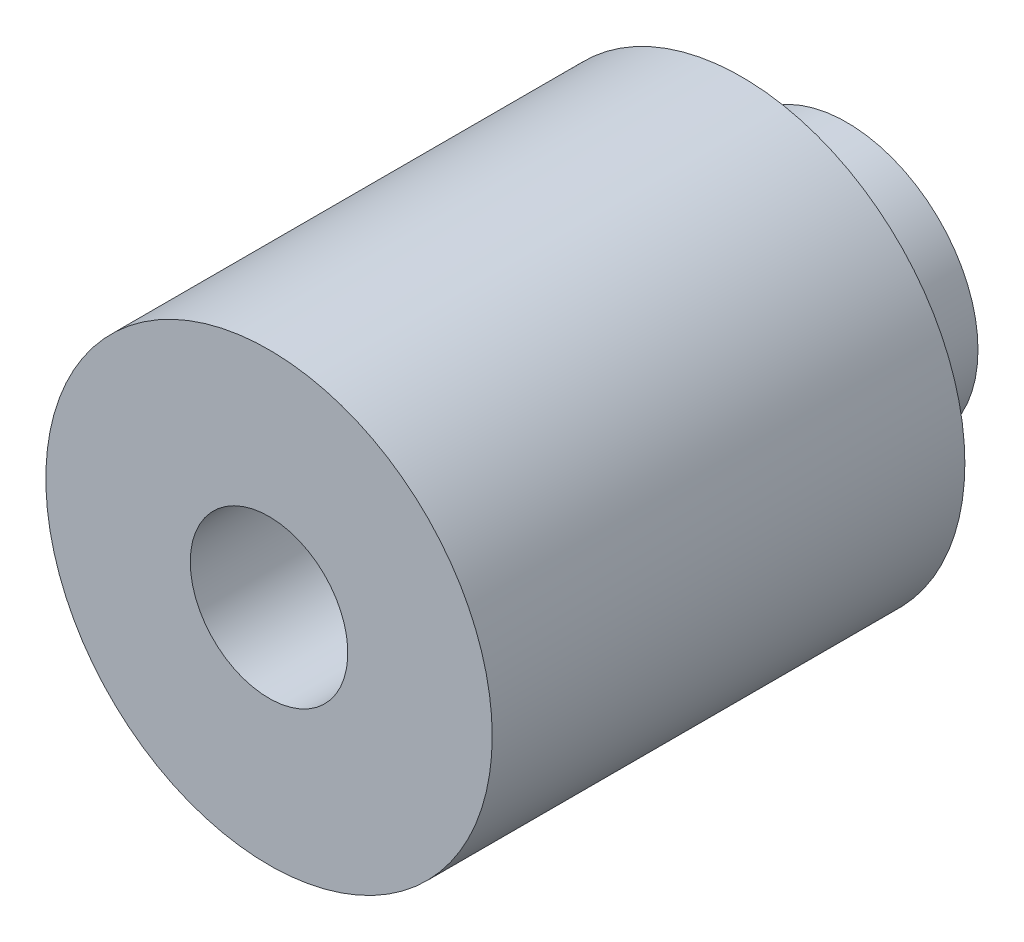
ISO-10303-21;
HEADER;
FILE_DESCRIPTION(('STEP AP214'),'2;1');
FILE_NAME('part.step','',(''),(''),'','','');
FILE_SCHEMA(('AUTOMOTIVE_DESIGN { 1 0 10303 214 1 1 1 1 }'));
ENDSEC;
DATA;
#1=APPLICATION_CONTEXT('core data for automotive mechanical design processes');
#2=APPLICATION_PROTOCOL_DEFINITION('international standard','automotive_design',2000,#1);
#3=PRODUCT_CONTEXT('',#1,'mechanical');
#4=PRODUCT('Part','Part','',(#3));
#5=PRODUCT_RELATED_PRODUCT_CATEGORY('part','',(#4));
#6=PRODUCT_DEFINITION_FORMATION('','',#4);
#7=PRODUCT_DEFINITION_CONTEXT('part definition',#1,'design');
#8=PRODUCT_DEFINITION('design','',#6,#7);
#9=PRODUCT_DEFINITION_SHAPE('','',#8);
#10=(LENGTH_UNIT() NAMED_UNIT(*) SI_UNIT(.MILLI.,.METRE.));
#11=(NAMED_UNIT(*) PLANE_ANGLE_UNIT() SI_UNIT($,.RADIAN.));
#12=(NAMED_UNIT(*) SI_UNIT($,.STERADIAN.) SOLID_ANGLE_UNIT());
#13=UNCERTAINTY_MEASURE_WITH_UNIT(LENGTH_MEASURE(1.E-05),#10,'distance_accuracy_value','');
#14=(GEOMETRIC_REPRESENTATION_CONTEXT(3) GLOBAL_UNCERTAINTY_ASSIGNED_CONTEXT((#13)) GLOBAL_UNIT_ASSIGNED_CONTEXT((#10,
#11,#12)) REPRESENTATION_CONTEXT('',''));
#15=CARTESIAN_POINT('',(0.,0.,0.));
#16=DIRECTION('',(0.,0.,1.));
#17=DIRECTION('',(1.,0.,0.));
#18=AXIS2_PLACEMENT_3D('',#15,#16,#17);
#19=CARTESIAN_POINT('',(0.,0.,42.));
#20=DIRECTION('',(0.,0.,1.));
#21=DIRECTION('',(1.,0.,0.));
#22=AXIS2_PLACEMENT_3D('',#19,#20,#21);
#23=CYLINDRICAL_SURFACE('',#22,8.5);
#24=CARTESIAN_POINT('',(0.,0.,22.));
#25=DIRECTION('',(0.,0.,1.));
#26=DIRECTION('',(1.,0.,0.));
#27=AXIS2_PLACEMENT_3D('',#24,#25,#26);
#28=CIRCLE('',#27,8.5);
#29=CARTESIAN_POINT('',(8.5,0.,22.));
#30=VERTEX_POINT('',#29);
#31=EDGE_CURVE('E8',#30,#30,#28,.T.);
#32=ORIENTED_EDGE('',*,*,#31,.F.);
#33=EDGE_LOOP('',(#32));
#34=FACE_BOUND('',#33,.T.);
#35=CARTESIAN_POINT('',(0.,0.,4.));
#36=DIRECTION('',(0.,0.,-1.));
#37=DIRECTION('',(-1.,0.,0.));
#38=AXIS2_PLACEMENT_3D('',#35,#36,#37);
#39=CIRCLE('',#38,8.5);
#40=CARTESIAN_POINT('',(-8.5,0.,4.));
#41=VERTEX_POINT('',#40);
#42=EDGE_CURVE('E28',#41,#41,#39,.F.);
#43=ORIENTED_EDGE('',*,*,#42,.T.);
#44=EDGE_LOOP('',(#43));
#45=FACE_BOUND('',#44,.T.);
#46=ADVANCED_FACE('F12',(#34,#45),#23,.T.);
#47=CARTESIAN_POINT('',(0.,0.,22.));
#48=DIRECTION('',(0.,0.,1.));
#49=DIRECTION('',(1.,0.,0.));
#50=AXIS2_PLACEMENT_3D('',#47,#48,#49);
#51=PLANE('',#50);
#52=ORIENTED_EDGE('',*,*,#31,.T.);
#53=EDGE_LOOP('',(#52));
#54=FACE_BOUND('',#53,.T.);
#55=CARTESIAN_POINT('',(0.,0.,22.));
#56=DIRECTION('',(0.,0.,-1.));
#57=DIRECTION('',(-1.,0.,0.));
#58=AXIS2_PLACEMENT_3D('',#55,#56,#57);
#59=CIRCLE('',#58,3.);
#60=CARTESIAN_POINT('',(-3.,0.,22.));
#61=VERTEX_POINT('',#60);
#62=EDGE_CURVE('E25',#61,#61,#59,.T.);
#63=ORIENTED_EDGE('',*,*,#62,.T.);
#64=EDGE_LOOP('',(#63));
#65=FACE_BOUND('',#64,.T.);
#66=ADVANCED_FACE('F41',(#54,#65),#51,.T.);
#67=CARTESIAN_POINT('',(0.,0.,14.5));
#68=DIRECTION('',(0.,0.,1.));
#69=DIRECTION('',(1.,0.,0.));
#70=AXIS2_PLACEMENT_3D('',#67,#68,#69);
#71=CYLINDRICAL_SURFACE('',#70,3.);
#72=CARTESIAN_POINT('',(0.,0.,14.5));
#73=DIRECTION('',(0.,0.,-1.));
#74=DIRECTION('',(-1.,0.,0.));
#75=AXIS2_PLACEMENT_3D('',#72,#73,#74);
#76=CIRCLE('',#75,3.);
#77=CARTESIAN_POINT('',(-3.,0.,14.5));
#78=VERTEX_POINT('',#77);
#79=EDGE_CURVE('E20',#78,#78,#76,.T.);
#80=ORIENTED_EDGE('',*,*,#79,.T.);
#81=EDGE_LOOP('',(#80));
#82=FACE_BOUND('',#81,.T.);
#83=ORIENTED_EDGE('',*,*,#62,.F.);
#84=EDGE_LOOP('',(#83));
#85=FACE_BOUND('',#84,.T.);
#86=ADVANCED_FACE('F43',(#82,#85),#71,.F.);
#87=CARTESIAN_POINT('',(0.,0.,14.5));
#88=DIRECTION('',(0.,0.,-1.));
#89=DIRECTION('',(-1.,0.,0.));
#90=AXIS2_PLACEMENT_3D('',#87,#88,#89);
#91=PLANE('',#90);
#92=ORIENTED_EDGE('',*,*,#79,.F.);
#93=EDGE_LOOP('',(#92));
#94=FACE_BOUND('',#93,.T.);
#95=ADVANCED_FACE('F45',(#94),#91,.F.);
#96=CARTESIAN_POINT('',(0.,0.,-18.));
#97=DIRECTION('',(0.,0.,-1.));
#98=DIRECTION('',(-1.,0.,0.));
#99=AXIS2_PLACEMENT_3D('',#96,#97,#98);
#100=CYLINDRICAL_SURFACE('',#99,5.);
#101=CARTESIAN_POINT('',(0.,0.,0.));
#102=DIRECTION('',(0.,0.,-1.));
#103=DIRECTION('',(-1.,0.,0.));
#104=AXIS2_PLACEMENT_3D('',#101,#102,#103);
#105=CIRCLE('',#104,5.);
#106=CARTESIAN_POINT('',(-5.,0.,0.));
#107=VERTEX_POINT('',#106);
#108=EDGE_CURVE('E16',#107,#107,#105,.F.);
#109=ORIENTED_EDGE('',*,*,#108,.T.);
#110=EDGE_LOOP('',(#109));
#111=FACE_BOUND('',#110,.T.);
#112=CARTESIAN_POINT('',(0.,0.,4.));
#113=DIRECTION('',(0.,0.,-1.));
#114=DIRECTION('',(-1.,0.,0.));
#115=AXIS2_PLACEMENT_3D('',#112,#113,#114);
#116=CIRCLE('',#115,5.);
#117=CARTESIAN_POINT('',(-5.,0.,4.));
#118=VERTEX_POINT('',#117);
#119=EDGE_CURVE('E30',#118,#118,#116,.T.);
#120=ORIENTED_EDGE('',*,*,#119,.T.);
#121=EDGE_LOOP('',(#120));
#122=FACE_BOUND('',#121,.T.);
#123=ADVANCED_FACE('F48',(#111,#122),#100,.T.);
#124=CARTESIAN_POINT('',(0.,5.,4.));
#125=DIRECTION('',(0.,0.,-1.));
#126=DIRECTION('',(-1.,0.,0.));
#127=AXIS2_PLACEMENT_3D('',#124,#125,#126);
#128=PLANE('',#127);
#129=ORIENTED_EDGE('',*,*,#42,.F.);
#130=EDGE_LOOP('',(#129));
#131=FACE_BOUND('',#130,.T.);
#132=ORIENTED_EDGE('',*,*,#119,.F.);
#133=EDGE_LOOP('',(#132));
#134=FACE_BOUND('',#133,.T.);
#135=ADVANCED_FACE('F58',(#131,#134),#128,.T.);
#136=CARTESIAN_POINT('',(8.5,0.,0.));
#137=DIRECTION('',(0.,0.,-1.));
#138=DIRECTION('',(-1.,0.,0.));
#139=AXIS2_PLACEMENT_3D('',#136,#137,#138);
#140=PLANE('',#139);
#141=ORIENTED_EDGE('',*,*,#108,.F.);
#142=EDGE_LOOP('',(#141));
#143=FACE_BOUND('',#142,.T.);
#144=ADVANCED_FACE('F14',(#143),#140,.T.);
#145=CLOSED_SHELL('',(#46,#66,#86,#95,#123,#135,#144));
#146=MANIFOLD_SOLID_BREP('B1',#145);
#147=ADVANCED_BREP_SHAPE_REPRESENTATION('',(#18,#146),#14);
#148=SHAPE_DEFINITION_REPRESENTATION(#9,#147);
ENDSEC;
END-ISO-10303-21;
